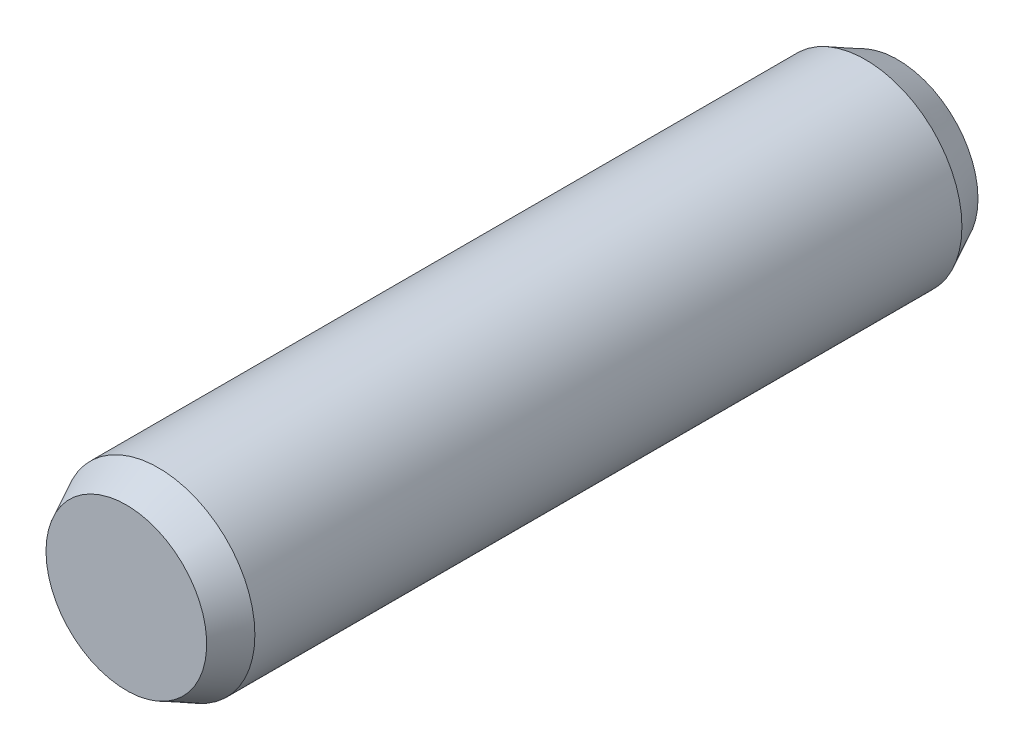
ISO-10303-21;
HEADER;
FILE_DESCRIPTION(('STEP AP214'),'2;1');
FILE_NAME('part.step','',(''),(''),'','','');
FILE_SCHEMA(('AUTOMOTIVE_DESIGN { 1 0 10303 214 1 1 1 1 }'));
ENDSEC;
DATA;
#1=APPLICATION_CONTEXT('core data for automotive mechanical design processes');
#2=APPLICATION_PROTOCOL_DEFINITION('international standard','automotive_design',2000,#1);
#3=PRODUCT_CONTEXT('',#1,'mechanical');
#4=PRODUCT('Part','Part','',(#3));
#5=PRODUCT_RELATED_PRODUCT_CATEGORY('part','',(#4));
#6=PRODUCT_DEFINITION_FORMATION('','',#4);
#7=PRODUCT_DEFINITION_CONTEXT('part definition',#1,'design');
#8=PRODUCT_DEFINITION('design','',#6,#7);
#9=PRODUCT_DEFINITION_SHAPE('','',#8);
#10=(LENGTH_UNIT() NAMED_UNIT(*) SI_UNIT(.MILLI.,.METRE.));
#11=(NAMED_UNIT(*) PLANE_ANGLE_UNIT() SI_UNIT($,.RADIAN.));
#12=(NAMED_UNIT(*) SI_UNIT($,.STERADIAN.) SOLID_ANGLE_UNIT());
#13=UNCERTAINTY_MEASURE_WITH_UNIT(LENGTH_MEASURE(1.E-05),#10,'distance_accuracy_value','');
#14=(GEOMETRIC_REPRESENTATION_CONTEXT(3) GLOBAL_UNCERTAINTY_ASSIGNED_CONTEXT((#13)) GLOBAL_UNIT_ASSIGNED_CONTEXT((#10,
#11,#12)) REPRESENTATION_CONTEXT('',''));
#15=CARTESIAN_POINT('',(0.,0.,0.));
#16=DIRECTION('',(0.,0.,1.));
#17=DIRECTION('',(1.,0.,0.));
#18=AXIS2_PLACEMENT_3D('',#15,#16,#17);
#19=CARTESIAN_POINT('',(0.,0.,12.));
#20=DIRECTION('',(0.,0.,-1.));
#21=DIRECTION('',(-1.,0.,0.));
#22=AXIS2_PLACEMENT_3D('',#19,#20,#21);
#23=PLANE('',#22);
#24=CARTESIAN_POINT('',(0.,0.,12.000000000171));
#25=DIRECTION('',(0.,0.,-1.));
#26=DIRECTION('',(-1.,0.,0.));
#27=AXIS2_PLACEMENT_3D('',#24,#25,#26);
#28=CIRCLE('',#27,2.50000000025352);
#29=CARTESIAN_POINT('',(-2.50000000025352,0.,12.000000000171));
#30=VERTEX_POINT('',#29);
#31=EDGE_CURVE('E17',#30,#30,#28,.T.);
#32=ORIENTED_EDGE('',*,*,#31,.F.);
#33=EDGE_LOOP('',(#32));
#34=FACE_BOUND('',#33,.T.);
#35=ADVANCED_FACE('F14',(#34),#23,.F.);
#36=CARTESIAN_POINT('',(0.,0.,-12.));
#37=DIRECTION('',(0.,0.,-1.));
#38=DIRECTION('',(-1.,0.,0.));
#39=AXIS2_PLACEMENT_3D('',#36,#37,#38);
#40=PLANE('',#39);
#41=CARTESIAN_POINT('',(0.,0.,-12.000000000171));
#42=DIRECTION('',(0.,0.,1.));
#43=DIRECTION('',(1.,0.,0.));
#44=AXIS2_PLACEMENT_3D('',#41,#42,#43);
#45=CIRCLE('',#44,2.50000000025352);
#46=CARTESIAN_POINT('',(2.50000000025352,0.,-12.000000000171));
#47=VERTEX_POINT('',#46);
#48=EDGE_CURVE('E26',#47,#47,#45,.T.);
#49=ORIENTED_EDGE('',*,*,#48,.F.);
#50=EDGE_LOOP('',(#49));
#51=FACE_BOUND('',#50,.T.);
#52=ADVANCED_FACE('F41',(#51),#40,.T.);
#53=CARTESIAN_POINT('',(0.,0.,10.9999999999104));
#54=DIRECTION('',(0.,0.,-1.));
#55=DIRECTION('',(-1.,0.,0.));
#56=AXIS2_PLACEMENT_3D('',#53,#54,#55);
#57=CONICAL_SURFACE('',#56,2.99999999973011,0.463647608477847);
#58=CARTESIAN_POINT('',(0.,0.,11.));
#59=DIRECTION('',(0.,0.,1.));
#60=DIRECTION('',(1.,0.,0.));
#61=AXIS2_PLACEMENT_3D('',#58,#59,#60);
#62=CIRCLE('',#61,3.);
#63=CARTESIAN_POINT('',(3.,0.,11.));
#64=VERTEX_POINT('',#63);
#65=EDGE_CURVE('E21',#64,#64,#62,.F.);
#66=ORIENTED_EDGE('',*,*,#65,.F.);
#67=EDGE_LOOP('',(#66));
#68=FACE_BOUND('',#67,.T.);
#69=ORIENTED_EDGE('',*,*,#31,.T.);
#70=EDGE_LOOP('',(#69));
#71=FACE_BOUND('',#70,.T.);
#72=ADVANCED_FACE('F38',(#68,#71),#57,.T.);
#73=CARTESIAN_POINT('',(0.,0.,-10.9999999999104));
#74=DIRECTION('',(0.,0.,1.));
#75=DIRECTION('',(1.,0.,0.));
#76=AXIS2_PLACEMENT_3D('',#73,#74,#75);
#77=CONICAL_SURFACE('',#76,2.99999999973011,0.463647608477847);
#78=CARTESIAN_POINT('',(0.,0.,-11.));
#79=DIRECTION('',(0.,0.,1.));
#80=DIRECTION('',(1.,0.,0.));
#81=AXIS2_PLACEMENT_3D('',#78,#79,#80);
#82=CIRCLE('',#81,3.);
#83=CARTESIAN_POINT('',(3.,0.,-11.));
#84=VERTEX_POINT('',#83);
#85=EDGE_CURVE('E10',#84,#84,#82,.T.);
#86=ORIENTED_EDGE('',*,*,#85,.F.);
#87=EDGE_LOOP('',(#86));
#88=FACE_BOUND('',#87,.T.);
#89=ORIENTED_EDGE('',*,*,#48,.T.);
#90=EDGE_LOOP('',(#89));
#91=FACE_BOUND('',#90,.T.);
#92=ADVANCED_FACE('F49',(#88,#91),#77,.T.);
#93=CARTESIAN_POINT('',(0.,0.,0.));
#94=DIRECTION('',(0.,0.,1.));
#95=DIRECTION('',(1.,0.,0.));
#96=AXIS2_PLACEMENT_3D('',#93,#94,#95);
#97=CYLINDRICAL_SURFACE('',#96,3.);
#98=ORIENTED_EDGE('',*,*,#85,.T.);
#99=EDGE_LOOP('',(#98));
#100=FACE_BOUND('',#99,.T.);
#101=ORIENTED_EDGE('',*,*,#65,.T.);
#102=EDGE_LOOP('',(#101));
#103=FACE_BOUND('',#102,.T.);
#104=ADVANCED_FACE('F47',(#100,#103),#97,.T.);
#105=CLOSED_SHELL('',(#35,#52,#72,#92,#104));
#106=MANIFOLD_SOLID_BREP('B1',#105);
#107=ADVANCED_BREP_SHAPE_REPRESENTATION('',(#18,#106),#14);
#108=SHAPE_DEFINITION_REPRESENTATION(#9,#107);
ENDSEC;
END-ISO-10303-21;
